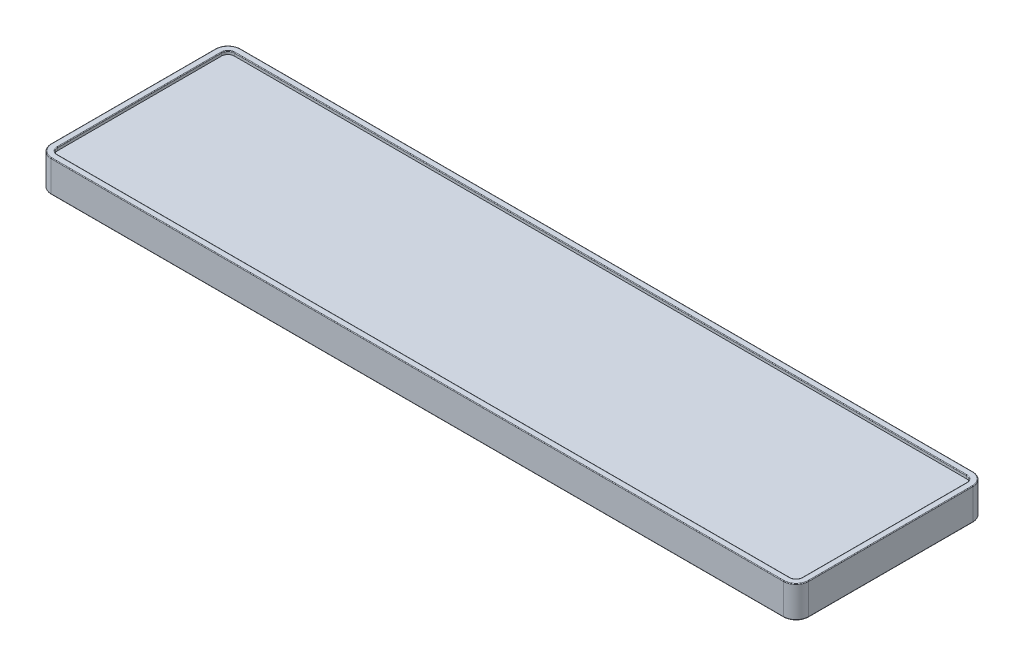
from build123d import *

# Parameters (mm, degrees)
SALIENTE_EXTRUIR1_DEPTH = 50
CORTAR_EXTRUIR1_DEPTH   = 5
VACIADO1_T              = -10
REDONDEO1_R             = 1
REDONDEO2_R             = 1


with BuildPart() as part:
    # Croquis1 → Saliente-Extruir1 (new body)
    with BuildSketch(Plane(origin=(0, 0, 0), x_dir=(1, 0, 0), z_dir=(0, 1, 0))):
        with BuildLine():
            Line((-580, -150), (580, -150))
            ThreePointArc((580, -150), (594.142135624, -144.142135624), (600, -130))
            Line((600, -130), (600, 130))
            ThreePointArc((600, 130), (594.142135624, 144.142135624), (580, 150))
            Line((580, 150), (-580, 150))
            ThreePointArc((-580, 150), (-594.142135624, 144.142135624), (-600, 130))
            Line((-600, 130), (-600, -130))
            ThreePointArc((-600, -130), (-594.142135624, -144.142135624), (-580, -150))
        make_face()
    extrude(amount=SALIENTE_EXTRUIR1_DEPTH)

    # Croquis2 → Cortar-Extruir1 (cut)
    with BuildSketch(Plane(origin=(0, 50, 0), x_dir=(1, 0, 0), z_dir=(0, 1, 0))):
        with BuildLine():
            Line((-580, -140), (580, -140))
            ThreePointArc((580, -140), (587.071067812, -137.071067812), (590, -130))
            Line((590, -130), (590, 130))
            ThreePointArc((590, 130), (587.071067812, 137.071067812), (580, 140))
            Line((580, 140), (-580, 140))
            ThreePointArc((-580, 140), (-587.071067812, 137.071067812), (-590, 130))
            Line((-590, 130), (-590, -130))
            ThreePointArc((-590, -130), (-587.071067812, -137.071067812), (-580, -140))
        make_face()
    extrude(amount=-CORTAR_EXTRUIR1_DEPTH, mode=Mode.SUBTRACT)

    # Vaciado1
    vaciado1_openings = [part.faces().sort_by_distance(p)[0] for p in [
        (0, 0, 0),
    ]]
    offset(amount=VACIADO1_T, openings=vaciado1_openings, kind=Kind.INTERSECTION)

    # Redondeo1
    redondeo1_edges = [part.edges().sort_by_distance(p)[0] for p in [
        (594.142135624, 50, 144.142135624),
        (600, 50, 0),
        (594.142135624, 50, -144.142135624),
        (0, 50, -150),
        (-594.142135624, 50, -144.142135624),
        (-587.071067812, 50, 137.071067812),
        (0, 50, 140),
        (587.071067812, 50, 137.071067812),
        (590, 50, 0),
        (587.071067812, 50, -137.071067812),
        (-600, 50, 0),
        (0, 50, -140),
        (-587.071067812, 50, -137.071067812),
        (-590, 50, 0),
        (-594.142135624, 50, 144.142135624),
        (0, 50, 150),
    ]]
    fillet(redondeo1_edges, radius=REDONDEO1_R)

    # Redondeo2
    redondeo2_edges = [part.edges().sort_by_distance(p)[0] for p in [
        (600, 0, 0),
        (594.142135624, 0, 144.142135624),
        (0, 0, 150),
        (-594.142135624, 0, 144.142135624),
        (-587.071067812, 0, 137.071067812),
        (0, 0, 140),
        (587.071067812, 0, 137.071067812),
        (590, 0, 0),
        (587.071067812, 0, -137.071067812),
        (0, 0, -140),
        (-587.071067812, 0, -137.071067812),
        (-590, 0, 0),
        (-600, 0, 0),
        (-594.142135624, 0, -144.142135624),
        (0, 0, -150),
        (594.142135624, 0, -144.142135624),
    ]]
    fillet(redondeo2_edges, radius=REDONDEO2_R)


solid = part.part
